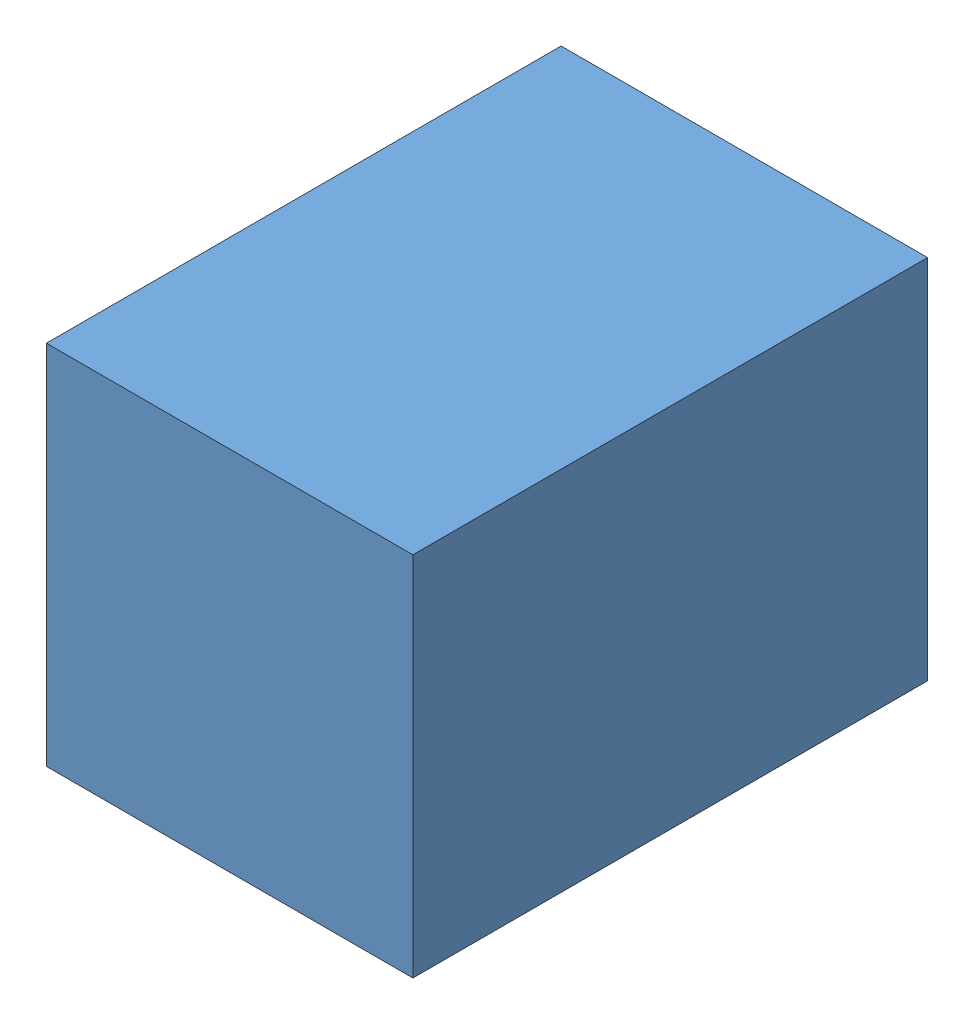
SolidWorks assembly Interim Assembly.SLDASM, configuration Default (file format 11000). Lengths in mm.
Overall size (142.4 142.4 200).
2 component instances, 2 part files, 4 mates.
Components (placement in the parent):
- Mold Base-1: Mold Base.SLDPRT [Default] at origin size (142.4 142.4 200)
- Model-1: Model.SLDPRT [Default] at origin size (122.4 122.4 163.2)
Mates (geometry in assembly coordinates):
- Width1: width: plane of ? through (0 0 100) normal (0 0 1); plane of ? through (0 0 -100) normal (0 0 -1); plane of ? through (0 0 81.6) normal (0 0 1); plane of ? through (0 0 -81.6) normal (0 0 -1)
- Width2: width: cylinder of ?; plane of ? through (-71.2 -71.2 100) normal (0 -1 0); cylinder of ? through (0 0 81.6) axis (0 0 1) radius 30.6
- Width3: width: plane of ? through (71.2 -71.2 100) normal (1 0 0); plane of ? through (-71.2 -71.2 100) normal (-1 0 0); cylinder of ? through (0 0 81.6) axis (0 0 1) radius 30.6
- Parallel1: parallel: plane of ? through (-71.2 71.2 100) normal (0 1 0); plane of ? through (0 0 0) normal (0 1 0)
